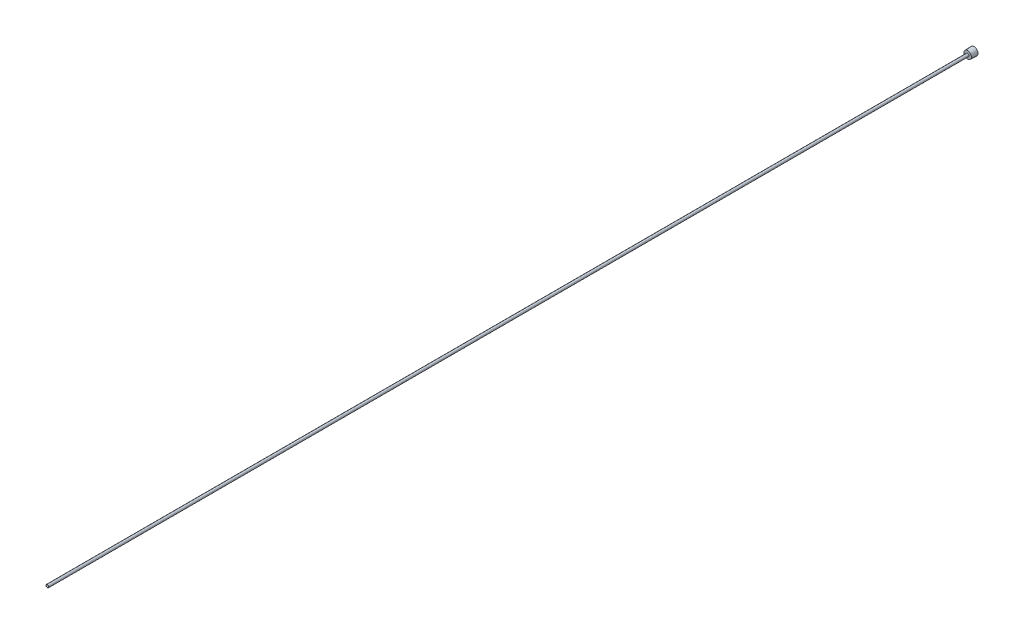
from build123d import *

# Parameters (mm, degrees)
SKETCH2_R          = 1.2065
CUT_EXTRUDE1_DEPTH = 915.416624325
CUT_EXTRUDE2_DEPTH = 3.96875


with BuildPart() as part:
    # Sketch1 → Revolve1 (revolve)
    with BuildSketch(Plane(origin=(0, 0, 0), x_dir=(0, 0, -1), z_dir=(1, 0, 0)), mode=Mode.PRIVATE) as revolve1_sk:
        Polygon((-914.4, 0), (0, 0), (0, 3.8989), (-6.35, 3.667387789), (-6.35, 1.3890625), (-914.4, 1.3890625), align=None)
    revolve(revolve1_sk.sketch.rotate(Axis((0, 0, 0), (0, 0, -1)), 90), axis=Axis((0, 0, 0), (0, 0, -1)))

    # Sketch2 → Cut-Extrude1 (cut, through all)
    with BuildSketch(Plane.XY.offset(914.4)):
        Circle(SKETCH2_R)
    extrude(amount=-CUT_EXTRUDE1_DEPTH, mode=Mode.SUBTRACT)

    # Sketch3 → Cut-Extrude2 (cut)
    with BuildSketch(Plane(origin=(0, 0, 0), x_dir=(-1, 0, 0), z_dir=(0, 0, -1))):
        Polygon((0, -2.756963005), (2.3876, -1.378481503), (2.3876, 1.378481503), (0, 2.756963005), (-2.3876, 1.378481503), (-2.3876, -1.378481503), align=None)
    extrude(amount=-CUT_EXTRUDE2_DEPTH, mode=Mode.SUBTRACT)


solid = part.part
